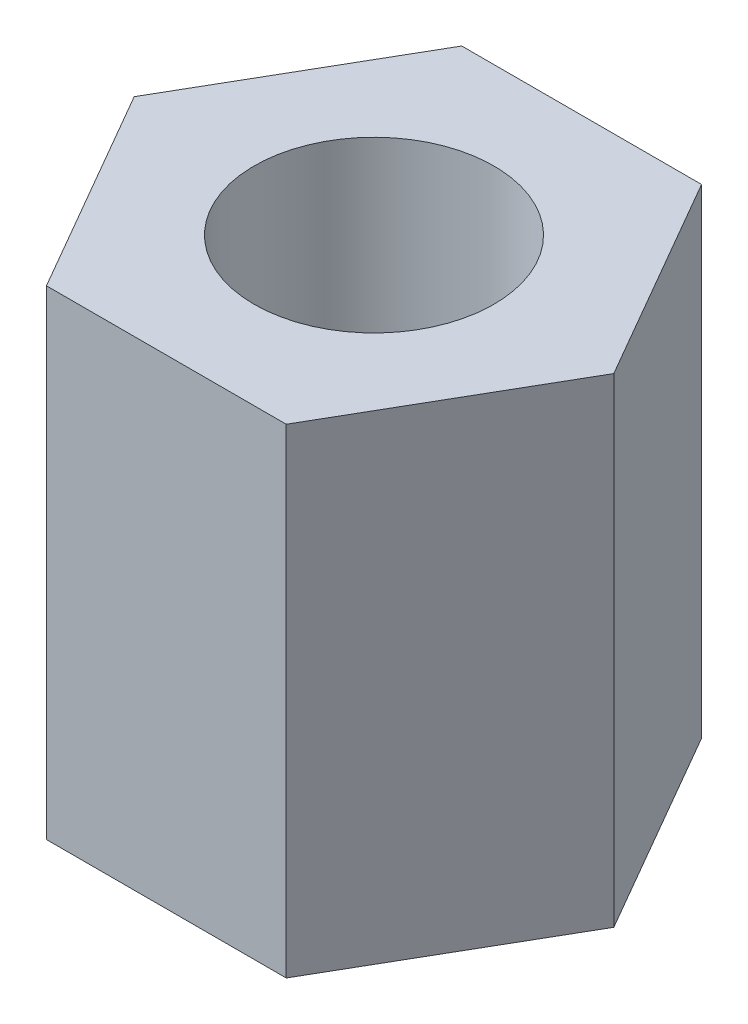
ISO-10303-21;
HEADER;
FILE_DESCRIPTION(('STEP AP214'),'2;1');
FILE_NAME('part.step','',(''),(''),'','','');
FILE_SCHEMA(('AUTOMOTIVE_DESIGN { 1 0 10303 214 1 1 1 1 }'));
ENDSEC;
DATA;
#1=APPLICATION_CONTEXT('core data for automotive mechanical design processes');
#2=APPLICATION_PROTOCOL_DEFINITION('international standard','automotive_design',2000,#1);
#3=PRODUCT_CONTEXT('',#1,'mechanical');
#4=PRODUCT('Part','Part','',(#3));
#5=PRODUCT_RELATED_PRODUCT_CATEGORY('part','',(#4));
#6=PRODUCT_DEFINITION_FORMATION('','',#4);
#7=PRODUCT_DEFINITION_CONTEXT('part definition',#1,'design');
#8=PRODUCT_DEFINITION('design','',#6,#7);
#9=PRODUCT_DEFINITION_SHAPE('','',#8);
#10=(LENGTH_UNIT() NAMED_UNIT(*) SI_UNIT(.MILLI.,.METRE.));
#11=(NAMED_UNIT(*) PLANE_ANGLE_UNIT() SI_UNIT($,.RADIAN.));
#12=(NAMED_UNIT(*) SI_UNIT($,.STERADIAN.) SOLID_ANGLE_UNIT());
#13=UNCERTAINTY_MEASURE_WITH_UNIT(LENGTH_MEASURE(1.E-05),#10,'distance_accuracy_value','');
#14=(GEOMETRIC_REPRESENTATION_CONTEXT(3) GLOBAL_UNCERTAINTY_ASSIGNED_CONTEXT((#13)) GLOBAL_UNIT_ASSIGNED_CONTEXT((#10,
#11,#12)) REPRESENTATION_CONTEXT('',''));
#15=CARTESIAN_POINT('',(0.,0.,0.));
#16=DIRECTION('',(0.,0.,1.));
#17=DIRECTION('',(1.,0.,0.));
#18=AXIS2_PLACEMENT_3D('',#15,#16,#17);
#19=CARTESIAN_POINT('',(2.,8.,3.46410161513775));
#20=DIRECTION('',(0.,-1.,0.));
#21=DIRECTION('',(0.,0.,-1.));
#22=AXIS2_PLACEMENT_3D('',#19,#20,#21);
#23=PLANE('',#22);
#24=DIRECTION('',(0.5,0.,-0.866025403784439));
#25=VECTOR('',#24,1.);
#26=CARTESIAN_POINT('',(2.,8.,3.46410161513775));
#27=LINE('',#26,#25);
#28=CARTESIAN_POINT('',(2.,8.,3.46410161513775));
#29=VERTEX_POINT('',#28);
#30=CARTESIAN_POINT('',(4.,8.,0.));
#31=VERTEX_POINT('',#30);
#32=EDGE_CURVE('E117',#29,#31,#27,.T.);
#33=ORIENTED_EDGE('',*,*,#32,.T.);
#34=DIRECTION('',(-0.5,0.,-0.866025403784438));
#35=VECTOR('',#34,1.);
#36=CARTESIAN_POINT('',(4.,8.,0.));
#37=LINE('',#36,#35);
#38=CARTESIAN_POINT('',(2.,8.,-3.46410161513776));
#39=VERTEX_POINT('',#38);
#40=EDGE_CURVE('E98',#31,#39,#37,.T.);
#41=ORIENTED_EDGE('',*,*,#40,.T.);
#42=DIRECTION('',(-1.,0.,0.));
#43=VECTOR('',#42,1.);
#44=CARTESIAN_POINT('',(2.,8.,-3.46410161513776));
#45=LINE('',#44,#43);
#46=CARTESIAN_POINT('',(-2.,8.,-3.46410161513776));
#47=VERTEX_POINT('',#46);
#48=EDGE_CURVE('E120',#39,#47,#45,.T.);
#49=ORIENTED_EDGE('',*,*,#48,.T.);
#50=DIRECTION('',(-0.5,0.,0.866025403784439));
#51=VECTOR('',#50,1.);
#52=CARTESIAN_POINT('',(-2.,8.,-3.46410161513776));
#53=LINE('',#52,#51);
#54=CARTESIAN_POINT('',(-4.,8.,0.));
#55=VERTEX_POINT('',#54);
#56=EDGE_CURVE('E122',#47,#55,#53,.T.);
#57=ORIENTED_EDGE('',*,*,#56,.T.);
#58=DIRECTION('',(0.5,0.,0.866025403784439));
#59=VECTOR('',#58,1.);
#60=CARTESIAN_POINT('',(-4.,8.,0.));
#61=LINE('',#60,#59);
#62=CARTESIAN_POINT('',(-2.,8.,3.46410161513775));
#63=VERTEX_POINT('',#62);
#64=EDGE_CURVE('E51',#55,#63,#61,.T.);
#65=ORIENTED_EDGE('',*,*,#64,.T.);
#66=DIRECTION('',(1.,0.,0.));
#67=VECTOR('',#66,1.);
#68=CARTESIAN_POINT('',(-2.,8.,3.46410161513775));
#69=LINE('',#68,#67);
#70=EDGE_CURVE('E46',#63,#29,#69,.T.);
#71=ORIENTED_EDGE('',*,*,#70,.T.);
#72=EDGE_LOOP('',(#33,#41,#49,#57,#65,#71));
#73=FACE_BOUND('',#72,.T.);
#74=CARTESIAN_POINT('',(0.,8.,0.));
#75=DIRECTION('',(0.,1.,0.));
#76=DIRECTION('',(0.,0.,1.));
#77=AXIS2_PLACEMENT_3D('',#74,#75,#76);
#78=CIRCLE('',#77,2.);
#79=CARTESIAN_POINT('',(0.,8.,2.));
#80=VERTEX_POINT('',#79);
#81=EDGE_CURVE('E103',#80,#80,#78,.T.);
#82=ORIENTED_EDGE('',*,*,#81,.F.);
#83=EDGE_LOOP('',(#82));
#84=FACE_BOUND('',#83,.T.);
#85=ADVANCED_FACE('F31',(#73,#84),#23,.F.);
#86=CARTESIAN_POINT('',(2.,0.,3.46410161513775));
#87=DIRECTION('',(0.,-1.,0.));
#88=DIRECTION('',(0.,0.,-1.));
#89=AXIS2_PLACEMENT_3D('',#86,#87,#88);
#90=PLANE('',#89);
#91=DIRECTION('',(0.5,0.,-0.866025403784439));
#92=VECTOR('',#91,1.);
#93=CARTESIAN_POINT('',(2.,0.,3.46410161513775));
#94=LINE('',#93,#92);
#95=CARTESIAN_POINT('',(2.,0.,3.46410161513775));
#96=VERTEX_POINT('',#95);
#97=CARTESIAN_POINT('',(4.,0.,0.));
#98=VERTEX_POINT('',#97);
#99=EDGE_CURVE('E89',#96,#98,#94,.T.);
#100=ORIENTED_EDGE('',*,*,#99,.F.);
#101=DIRECTION('',(1.,0.,0.));
#102=VECTOR('',#101,1.);
#103=CARTESIAN_POINT('',(-2.,0.,3.46410161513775));
#104=LINE('',#103,#102);
#105=CARTESIAN_POINT('',(-2.,0.,3.46410161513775));
#106=VERTEX_POINT('',#105);
#107=EDGE_CURVE('E115',#106,#96,#104,.T.);
#108=ORIENTED_EDGE('',*,*,#107,.F.);
#109=DIRECTION('',(0.5,0.,0.866025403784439));
#110=VECTOR('',#109,1.);
#111=CARTESIAN_POINT('',(-4.,0.,0.));
#112=LINE('',#111,#110);
#113=CARTESIAN_POINT('',(-4.,0.,0.));
#114=VERTEX_POINT('',#113);
#115=EDGE_CURVE('E113',#114,#106,#112,.T.);
#116=ORIENTED_EDGE('',*,*,#115,.F.);
#117=DIRECTION('',(-0.5,0.,0.866025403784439));
#118=VECTOR('',#117,1.);
#119=CARTESIAN_POINT('',(-2.,0.,-3.46410161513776));
#120=LINE('',#119,#118);
#121=CARTESIAN_POINT('',(-2.,0.,-3.46410161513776));
#122=VERTEX_POINT('',#121);
#123=EDGE_CURVE('E111',#122,#114,#120,.T.);
#124=ORIENTED_EDGE('',*,*,#123,.F.);
#125=DIRECTION('',(-1.,0.,0.));
#126=VECTOR('',#125,1.);
#127=CARTESIAN_POINT('',(2.,0.,-3.46410161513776));
#128=LINE('',#127,#126);
#129=CARTESIAN_POINT('',(2.,0.,-3.46410161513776));
#130=VERTEX_POINT('',#129);
#131=EDGE_CURVE('E91',#130,#122,#128,.T.);
#132=ORIENTED_EDGE('',*,*,#131,.F.);
#133=DIRECTION('',(-0.5,0.,-0.866025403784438));
#134=VECTOR('',#133,1.);
#135=CARTESIAN_POINT('',(4.,0.,0.));
#136=LINE('',#135,#134);
#137=EDGE_CURVE('E84',#98,#130,#136,.T.);
#138=ORIENTED_EDGE('',*,*,#137,.F.);
#139=EDGE_LOOP('',(#100,#108,#116,#124,#132,#138));
#140=FACE_BOUND('',#139,.T.);
#141=CARTESIAN_POINT('',(0.,0.,0.));
#142=DIRECTION('',(0.,1.,0.));
#143=DIRECTION('',(0.,0.,1.));
#144=AXIS2_PLACEMENT_3D('',#141,#142,#143);
#145=CIRCLE('',#144,2.);
#146=CARTESIAN_POINT('',(0.,0.,2.));
#147=VERTEX_POINT('',#146);
#148=EDGE_CURVE('E106',#147,#147,#145,.T.);
#149=ORIENTED_EDGE('',*,*,#148,.T.);
#150=EDGE_LOOP('',(#149));
#151=FACE_BOUND('',#150,.T.);
#152=ADVANCED_FACE('F85',(#140,#151),#90,.T.);
#153=CARTESIAN_POINT('',(2.,8.,3.46410161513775));
#154=DIRECTION('',(-0.866025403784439,0.,-0.5));
#155=DIRECTION('',(-0.5,0.,0.866025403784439));
#156=AXIS2_PLACEMENT_3D('',#153,#154,#155);
#157=PLANE('',#156);
#158=ORIENTED_EDGE('',*,*,#99,.T.);
#159=DIRECTION('',(0.,-1.,0.));
#160=VECTOR('',#159,1.);
#161=CARTESIAN_POINT('',(4.,8.,0.));
#162=LINE('',#161,#160);
#163=EDGE_CURVE('E11',#31,#98,#162,.T.);
#164=ORIENTED_EDGE('',*,*,#163,.F.);
#165=ORIENTED_EDGE('',*,*,#32,.F.);
#166=DIRECTION('',(0.,-1.,0.));
#167=VECTOR('',#166,1.);
#168=CARTESIAN_POINT('',(2.,8.,3.46410161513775));
#169=LINE('',#168,#167);
#170=EDGE_CURVE('E102',#29,#96,#169,.T.);
#171=ORIENTED_EDGE('',*,*,#170,.T.);
#172=EDGE_LOOP('',(#158,#164,#165,#171));
#173=FACE_BOUND('',#172,.T.);
#174=ADVANCED_FACE('F33',(#173),#157,.F.);
#175=CARTESIAN_POINT('',(4.,8.,0.));
#176=DIRECTION('',(-0.866025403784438,0.,0.5));
#177=DIRECTION('',(0.5,0.,0.866025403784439));
#178=AXIS2_PLACEMENT_3D('',#175,#176,#177);
#179=PLANE('',#178);
#180=ORIENTED_EDGE('',*,*,#137,.T.);
#181=DIRECTION('',(0.,-1.,0.));
#182=VECTOR('',#181,1.);
#183=CARTESIAN_POINT('',(2.,8.,-3.46410161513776));
#184=LINE('',#183,#182);
#185=EDGE_CURVE('E39',#39,#130,#184,.T.);
#186=ORIENTED_EDGE('',*,*,#185,.F.);
#187=ORIENTED_EDGE('',*,*,#40,.F.);
#188=ORIENTED_EDGE('',*,*,#163,.T.);
#189=EDGE_LOOP('',(#180,#186,#187,#188));
#190=FACE_BOUND('',#189,.T.);
#191=ADVANCED_FACE('F97',(#190),#179,.F.);
#192=CARTESIAN_POINT('',(2.,8.,-3.46410161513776));
#193=DIRECTION('',(0.,0.,1.));
#194=DIRECTION('',(1.,0.,0.));
#195=AXIS2_PLACEMENT_3D('',#192,#193,#194);
#196=PLANE('',#195);
#197=ORIENTED_EDGE('',*,*,#131,.T.);
#198=DIRECTION('',(0.,-1.,0.));
#199=VECTOR('',#198,1.);
#200=CARTESIAN_POINT('',(-2.,8.,-3.46410161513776));
#201=LINE('',#200,#199);
#202=EDGE_CURVE('E133',#47,#122,#201,.T.);
#203=ORIENTED_EDGE('',*,*,#202,.F.);
#204=ORIENTED_EDGE('',*,*,#48,.F.);
#205=ORIENTED_EDGE('',*,*,#185,.T.);
#206=EDGE_LOOP('',(#197,#203,#204,#205));
#207=FACE_BOUND('',#206,.T.);
#208=ADVANCED_FACE('F137',(#207),#196,.F.);
#209=CARTESIAN_POINT('',(-2.,8.,-3.46410161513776));
#210=DIRECTION('',(0.866025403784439,0.,0.5));
#211=DIRECTION('',(0.5,0.,-0.866025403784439));
#212=AXIS2_PLACEMENT_3D('',#209,#210,#211);
#213=PLANE('',#212);
#214=ORIENTED_EDGE('',*,*,#123,.T.);
#215=DIRECTION('',(0.,-1.,0.));
#216=VECTOR('',#215,1.);
#217=CARTESIAN_POINT('',(-4.,8.,0.));
#218=LINE('',#217,#216);
#219=EDGE_CURVE('E130',#55,#114,#218,.T.);
#220=ORIENTED_EDGE('',*,*,#219,.F.);
#221=ORIENTED_EDGE('',*,*,#56,.F.);
#222=ORIENTED_EDGE('',*,*,#202,.T.);
#223=EDGE_LOOP('',(#214,#220,#221,#222));
#224=FACE_BOUND('',#223,.T.);
#225=ADVANCED_FACE('F143',(#224),#213,.F.);
#226=CARTESIAN_POINT('',(-4.,8.,0.));
#227=DIRECTION('',(0.866025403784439,0.,-0.5));
#228=DIRECTION('',(-0.5,0.,-0.866025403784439));
#229=AXIS2_PLACEMENT_3D('',#226,#227,#228);
#230=PLANE('',#229);
#231=ORIENTED_EDGE('',*,*,#115,.T.);
#232=DIRECTION('',(0.,-1.,0.));
#233=VECTOR('',#232,1.);
#234=CARTESIAN_POINT('',(-2.,8.,3.46410161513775));
#235=LINE('',#234,#233);
#236=EDGE_CURVE('E127',#63,#106,#235,.T.);
#237=ORIENTED_EDGE('',*,*,#236,.F.);
#238=ORIENTED_EDGE('',*,*,#64,.F.);
#239=ORIENTED_EDGE('',*,*,#219,.T.);
#240=EDGE_LOOP('',(#231,#237,#238,#239));
#241=FACE_BOUND('',#240,.T.);
#242=ADVANCED_FACE('F146',(#241),#230,.F.);
#243=CARTESIAN_POINT('',(-2.,8.,3.46410161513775));
#244=DIRECTION('',(0.,0.,-1.));
#245=DIRECTION('',(-1.,0.,0.));
#246=AXIS2_PLACEMENT_3D('',#243,#244,#245);
#247=PLANE('',#246);
#248=ORIENTED_EDGE('',*,*,#107,.T.);
#249=ORIENTED_EDGE('',*,*,#170,.F.);
#250=ORIENTED_EDGE('',*,*,#70,.F.);
#251=ORIENTED_EDGE('',*,*,#236,.T.);
#252=EDGE_LOOP('',(#248,#249,#250,#251));
#253=FACE_BOUND('',#252,.T.);
#254=ADVANCED_FACE('F148',(#253),#247,.F.);
#255=CARTESIAN_POINT('',(0.,8.,0.));
#256=DIRECTION('',(0.,-1.,0.));
#257=DIRECTION('',(0.,0.,-1.));
#258=AXIS2_PLACEMENT_3D('',#255,#256,#257);
#259=CYLINDRICAL_SURFACE('',#258,2.);
#260=ORIENTED_EDGE('',*,*,#81,.T.);
#261=EDGE_LOOP('',(#260));
#262=FACE_BOUND('',#261,.T.);
#263=ORIENTED_EDGE('',*,*,#148,.F.);
#264=EDGE_LOOP('',(#263));
#265=FACE_BOUND('',#264,.T.);
#266=ADVANCED_FACE('F150',(#262,#265),#259,.F.);
#267=CLOSED_SHELL('',(#85,#152,#174,#191,#208,#225,#242,#254,#266));
#268=MANIFOLD_SOLID_BREP('B2',#267);
#269=ADVANCED_BREP_SHAPE_REPRESENTATION('',(#18,#268),#14);
#270=SHAPE_DEFINITION_REPRESENTATION(#9,#269);
ENDSEC;
END-ISO-10303-21;
